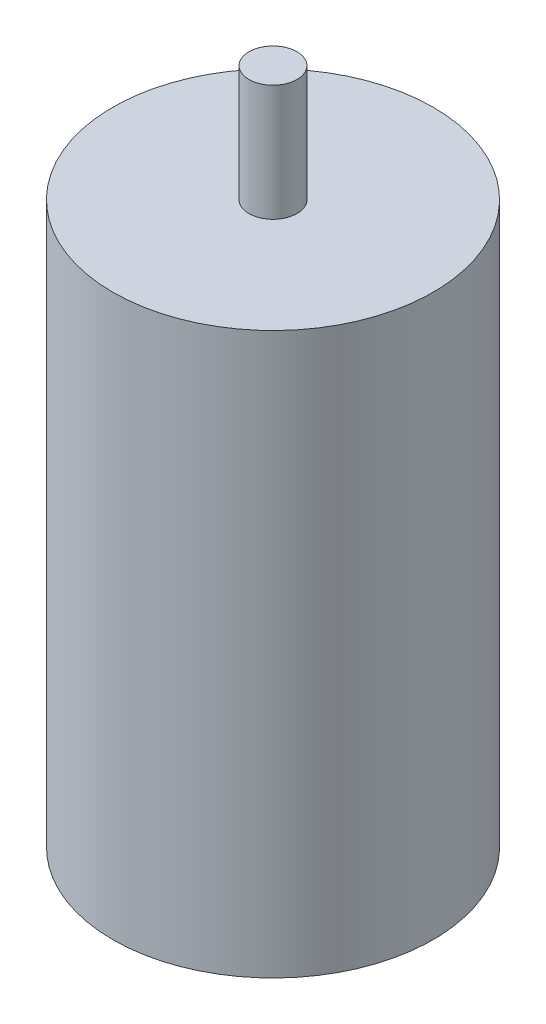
ISO-10303-21;
HEADER;
FILE_DESCRIPTION(('STEP AP214'),'2;1');
FILE_NAME('part.step','',(''),(''),'','','');
FILE_SCHEMA(('AUTOMOTIVE_DESIGN { 1 0 10303 214 1 1 1 1 }'));
ENDSEC;
DATA;
#1=APPLICATION_CONTEXT('core data for automotive mechanical design processes');
#2=APPLICATION_PROTOCOL_DEFINITION('international standard','automotive_design',2000,#1);
#3=PRODUCT_CONTEXT('',#1,'mechanical');
#4=PRODUCT('Part','Part','',(#3));
#5=PRODUCT_RELATED_PRODUCT_CATEGORY('part','',(#4));
#6=PRODUCT_DEFINITION_FORMATION('','',#4);
#7=PRODUCT_DEFINITION_CONTEXT('part definition',#1,'design');
#8=PRODUCT_DEFINITION('design','',#6,#7);
#9=PRODUCT_DEFINITION_SHAPE('','',#8);
#10=(LENGTH_UNIT() NAMED_UNIT(*) SI_UNIT(.MILLI.,.METRE.));
#11=(NAMED_UNIT(*) PLANE_ANGLE_UNIT() SI_UNIT($,.RADIAN.));
#12=(NAMED_UNIT(*) SI_UNIT($,.STERADIAN.) SOLID_ANGLE_UNIT());
#13=UNCERTAINTY_MEASURE_WITH_UNIT(LENGTH_MEASURE(1.E-05),#10,'distance_accuracy_value','');
#14=(GEOMETRIC_REPRESENTATION_CONTEXT(3) GLOBAL_UNCERTAINTY_ASSIGNED_CONTEXT((#13)) GLOBAL_UNIT_ASSIGNED_CONTEXT((#10,
#11,#12)) REPRESENTATION_CONTEXT('',''));
#15=CARTESIAN_POINT('',(0.,0.,0.));
#16=DIRECTION('',(0.,0.,1.));
#17=DIRECTION('',(1.,0.,0.));
#18=AXIS2_PLACEMENT_3D('',#15,#16,#17);
#19=CARTESIAN_POINT('',(0.,70.,0.));
#20=DIRECTION('',(0.,1.,0.));
#21=DIRECTION('',(0.,0.,1.));
#22=AXIS2_PLACEMENT_3D('',#19,#20,#21);
#23=PLANE('',#22);
#24=CARTESIAN_POINT('',(0.,70.,0.));
#25=DIRECTION('',(0.,1.,0.));
#26=DIRECTION('',(0.,0.,1.));
#27=AXIS2_PLACEMENT_3D('',#24,#25,#26);
#28=CIRCLE('',#27,20.);
#29=CARTESIAN_POINT('',(0.,70.,20.));
#30=VERTEX_POINT('',#29);
#31=EDGE_CURVE('E10',#30,#30,#28,.T.);
#32=ORIENTED_EDGE('',*,*,#31,.T.);
#33=EDGE_LOOP('',(#32));
#34=FACE_BOUND('',#33,.T.);
#35=CARTESIAN_POINT('',(0.,70.,0.));
#36=DIRECTION('',(0.,1.,0.));
#37=DIRECTION('',(0.,0.,1.));
#38=AXIS2_PLACEMENT_3D('',#35,#36,#37);
#39=CIRCLE('',#38,3.);
#40=CARTESIAN_POINT('',(0.,70.,-3.));
#41=VERTEX_POINT('',#40);
#42=EDGE_CURVE('E49',#41,#41,#39,.T.);
#43=ORIENTED_EDGE('',*,*,#42,.F.);
#44=EDGE_LOOP('',(#43));
#45=FACE_BOUND('',#44,.T.);
#46=ADVANCED_FACE('F34',(#34,#45),#23,.T.);
#47=CARTESIAN_POINT('',(0.,70.,0.));
#48=DIRECTION('',(0.,-1.,0.));
#49=DIRECTION('',(0.,0.,-1.));
#50=AXIS2_PLACEMENT_3D('',#47,#48,#49);
#51=CYLINDRICAL_SURFACE('',#50,20.);
#52=ORIENTED_EDGE('',*,*,#31,.F.);
#53=EDGE_LOOP('',(#52));
#54=FACE_BOUND('',#53,.T.);
#55=CARTESIAN_POINT('',(0.,0.,0.));
#56=DIRECTION('',(0.,1.,0.));
#57=DIRECTION('',(0.,0.,1.));
#58=AXIS2_PLACEMENT_3D('',#55,#56,#57);
#59=CIRCLE('',#58,20.);
#60=CARTESIAN_POINT('',(0.,0.,20.));
#61=VERTEX_POINT('',#60);
#62=EDGE_CURVE('E41',#61,#61,#59,.T.);
#63=ORIENTED_EDGE('',*,*,#62,.T.);
#64=EDGE_LOOP('',(#63));
#65=FACE_BOUND('',#64,.T.);
#66=ADVANCED_FACE('F36',(#54,#65),#51,.T.);
#67=CARTESIAN_POINT('',(0.,0.,0.));
#68=DIRECTION('',(0.,1.,0.));
#69=DIRECTION('',(0.,0.,1.));
#70=AXIS2_PLACEMENT_3D('',#67,#68,#69);
#71=PLANE('',#70);
#72=ORIENTED_EDGE('',*,*,#62,.F.);
#73=EDGE_LOOP('',(#72));
#74=FACE_BOUND('',#73,.T.);
#75=ADVANCED_FACE('F61',(#74),#71,.F.);
#76=CARTESIAN_POINT('',(0.,84.5,0.));
#77=DIRECTION('',(0.,-1.,0.));
#78=DIRECTION('',(0.,0.,-1.));
#79=AXIS2_PLACEMENT_3D('',#76,#77,#78);
#80=CYLINDRICAL_SURFACE('',#79,3.);
#81=CARTESIAN_POINT('',(0.,84.5,0.));
#82=DIRECTION('',(0.,1.,0.));
#83=DIRECTION('',(0.,0.,1.));
#84=AXIS2_PLACEMENT_3D('',#81,#82,#83);
#85=CIRCLE('',#84,3.);
#86=CARTESIAN_POINT('',(0.,84.5,-3.));
#87=VERTEX_POINT('',#86);
#88=EDGE_CURVE('E45',#87,#87,#85,.T.);
#89=CARTESIAN_POINT('',(0.,84.5,-3.));
#90=CARTESIAN_POINT('',(0.,84.3489583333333,-3.));
#91=CARTESIAN_POINT('',(0.,84.1979166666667,-3.));
#92=CARTESIAN_POINT('',(0.,83.8958333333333,-3.));
#93=CARTESIAN_POINT('',(0.,83.7447916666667,-3.));
#94=CARTESIAN_POINT('',(0.,83.4427083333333,-3.));
#95=CARTESIAN_POINT('',(0.,83.2916666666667,-3.));
#96=CARTESIAN_POINT('',(0.,82.9895833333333,-3.));
#97=CARTESIAN_POINT('',(0.,82.8385416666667,-3.));
#98=CARTESIAN_POINT('',(0.,82.5364583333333,-3.));
#99=CARTESIAN_POINT('',(0.,82.3854166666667,-3.));
#100=CARTESIAN_POINT('',(0.,82.0833333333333,-3.));
#101=CARTESIAN_POINT('',(0.,81.9322916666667,-3.));
#102=CARTESIAN_POINT('',(0.,81.6302083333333,-3.));
#103=CARTESIAN_POINT('',(0.,81.4791666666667,-3.));
#104=CARTESIAN_POINT('',(0.,81.1770833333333,-3.));
#105=CARTESIAN_POINT('',(0.,81.0260416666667,-3.));
#106=CARTESIAN_POINT('',(0.,80.7239583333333,-3.));
#107=CARTESIAN_POINT('',(0.,80.5729166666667,-3.));
#108=CARTESIAN_POINT('',(0.,80.2708333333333,-3.));
#109=CARTESIAN_POINT('',(0.,80.1197916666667,-3.));
#110=CARTESIAN_POINT('',(0.,79.8177083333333,-3.));
#111=CARTESIAN_POINT('',(0.,79.6666666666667,-3.));
#112=CARTESIAN_POINT('',(0.,79.3645833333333,-3.));
#113=CARTESIAN_POINT('',(0.,79.2135416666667,-3.));
#114=CARTESIAN_POINT('',(0.,78.9114583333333,-3.));
#115=CARTESIAN_POINT('',(0.,78.7604166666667,-3.));
#116=CARTESIAN_POINT('',(0.,78.4583333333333,-3.));
#117=CARTESIAN_POINT('',(0.,78.3072916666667,-3.));
#118=CARTESIAN_POINT('',(0.,78.0052083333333,-3.));
#119=CARTESIAN_POINT('',(0.,77.8541666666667,-3.));
#120=CARTESIAN_POINT('',(0.,77.5520833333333,-3.));
#121=CARTESIAN_POINT('',(0.,77.4010416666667,-3.));
#122=CARTESIAN_POINT('',(0.,77.0989583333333,-3.));
#123=CARTESIAN_POINT('',(0.,76.9479166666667,-3.));
#124=CARTESIAN_POINT('',(0.,76.6458333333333,-3.));
#125=CARTESIAN_POINT('',(0.,76.4947916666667,-3.));
#126=CARTESIAN_POINT('',(0.,76.1927083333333,-3.));
#127=CARTESIAN_POINT('',(0.,76.0416666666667,-3.));
#128=CARTESIAN_POINT('',(0.,75.7395833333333,-3.));
#129=CARTESIAN_POINT('',(0.,75.5885416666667,-3.));
#130=CARTESIAN_POINT('',(0.,75.2864583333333,-3.));
#131=CARTESIAN_POINT('',(0.,75.1354166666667,-3.));
#132=CARTESIAN_POINT('',(0.,74.8333333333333,-3.));
#133=CARTESIAN_POINT('',(0.,74.6822916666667,-3.));
#134=CARTESIAN_POINT('',(0.,74.3802083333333,-3.));
#135=CARTESIAN_POINT('',(0.,74.2291666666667,-3.));
#136=CARTESIAN_POINT('',(0.,73.9270833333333,-3.));
#137=CARTESIAN_POINT('',(0.,73.7760416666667,-3.));
#138=CARTESIAN_POINT('',(0.,73.4739583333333,-3.));
#139=CARTESIAN_POINT('',(0.,73.3229166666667,-3.));
#140=CARTESIAN_POINT('',(0.,73.0208333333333,-3.));
#141=CARTESIAN_POINT('',(0.,72.8697916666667,-3.));
#142=CARTESIAN_POINT('',(0.,72.5677083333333,-3.));
#143=CARTESIAN_POINT('',(0.,72.4166666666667,-3.));
#144=CARTESIAN_POINT('',(0.,72.1145833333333,-3.));
#145=CARTESIAN_POINT('',(0.,71.9635416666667,-3.));
#146=CARTESIAN_POINT('',(0.,71.6614583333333,-3.));
#147=CARTESIAN_POINT('',(0.,71.5104166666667,-3.));
#148=CARTESIAN_POINT('',(0.,71.2083333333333,-3.));
#149=CARTESIAN_POINT('',(0.,71.0572916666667,-3.));
#150=CARTESIAN_POINT('',(0.,70.7552083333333,-3.));
#151=CARTESIAN_POINT('',(0.,70.6041666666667,-3.));
#152=CARTESIAN_POINT('',(0.,70.3020833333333,-3.));
#153=CARTESIAN_POINT('',(0.,70.1510416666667,-3.));
#154=CARTESIAN_POINT('',(0.,70.,-3.));
#155=B_SPLINE_CURVE_WITH_KNOTS('',3,(#89,#90,#91,#92,#93,#94,#95,#96,#97,#98,#99,#100,#101,#102,
#103,#104,#105,#106,#107,#108,#109,#110,#111,#112,#113,#114,#115,#116,#117,#118,#119,#120,#121,
#122,#123,#124,#125,#126,#127,#128,#129,#130,#131,#132,#133,#134,#135,#136,#137,#138,#139,#140,
#141,#142,#143,#144,#145,#146,#147,#148,#149,#150,#151,#152,#153,#154),.UNSPECIFIED.,.F.,.F.,(4,
2,2,2,2,2,2,2,2,2,2,2,2,2,2,2,2,2,2,2,2,2,2,2,2,2,2,2,2,2,2,2,4),(0.,0.453124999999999,
0.906249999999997,1.359375,1.81249999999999,2.26562499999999,2.71874999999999,3.17187499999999,
3.62499999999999,4.07812499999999,4.53124999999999,4.984375,5.4375,5.890625,6.34375,
6.79687499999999,7.24999999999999,7.70312499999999,8.15624999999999,8.60937499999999,
9.06249999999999,9.515625,9.96875,10.421875,10.875,11.328125,11.78125,12.234375,12.6875,
13.140625,13.59375,14.046875,14.5),.UNSPECIFIED.);
#156=EDGE_CURVE('BSEAM55',#87,#41,#155,.T.);
#157=ORIENTED_EDGE('',*,*,#88,.F.);
#158=ORIENTED_EDGE('',*,*,#42,.T.);
#159=ORIENTED_EDGE('',*,*,#156,.T.);
#160=ORIENTED_EDGE('',*,*,#156,.F.);
#161=EDGE_LOOP('',(#157,#159,#158,#160));
#162=FACE_BOUND('',#161,.T.);
#163=ADVANCED_FACE('F55',(#162),#80,.T.);
#164=CARTESIAN_POINT('',(0.,84.5,0.));
#165=DIRECTION('',(0.,1.,0.));
#166=DIRECTION('',(0.,0.,1.));
#167=AXIS2_PLACEMENT_3D('',#164,#165,#166);
#168=PLANE('',#167);
#169=ORIENTED_EDGE('',*,*,#88,.T.);
#170=EDGE_LOOP('',(#169));
#171=FACE_BOUND('',#170,.T.);
#172=ADVANCED_FACE('F69',(#171),#168,.T.);
#173=CLOSED_SHELL('',(#46,#66,#75,#163,#172));
#174=MANIFOLD_SOLID_BREP('B2',#173);
#175=ADVANCED_BREP_SHAPE_REPRESENTATION('',(#18,#174),#14);
#176=SHAPE_DEFINITION_REPRESENTATION(#9,#175);
ENDSEC;
END-ISO-10303-21;
